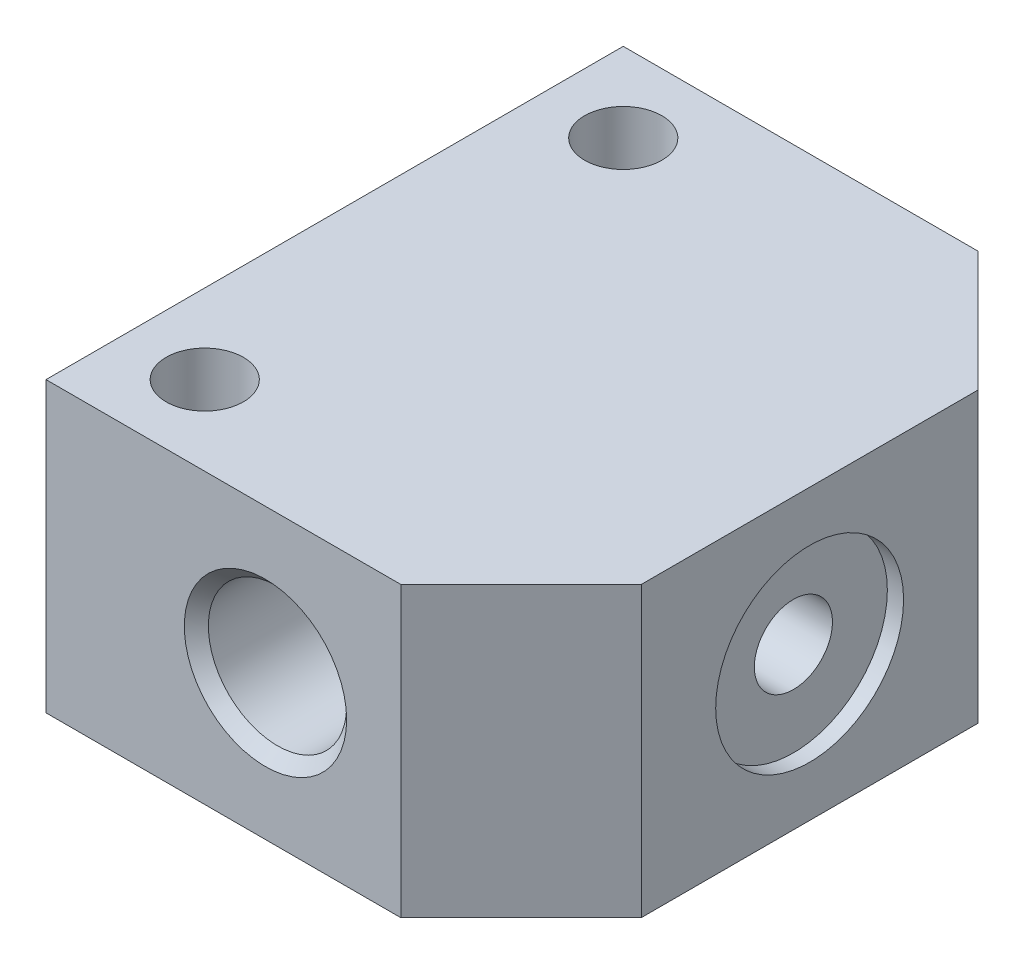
ISO-10303-21;
HEADER;
FILE_DESCRIPTION(('STEP AP214'),'2;1');
FILE_NAME('part.step','',(''),(''),'','','');
FILE_SCHEMA(('AUTOMOTIVE_DESIGN { 1 0 10303 214 1 1 1 1 }'));
ENDSEC;
DATA;
#1=APPLICATION_CONTEXT('core data for automotive mechanical design processes');
#2=APPLICATION_PROTOCOL_DEFINITION('international standard','automotive_design',2000,#1);
#3=PRODUCT_CONTEXT('',#1,'mechanical');
#4=PRODUCT('Part','Part','',(#3));
#5=PRODUCT_RELATED_PRODUCT_CATEGORY('part','',(#4));
#6=PRODUCT_DEFINITION_FORMATION('','',#4);
#7=PRODUCT_DEFINITION_CONTEXT('part definition',#1,'design');
#8=PRODUCT_DEFINITION('design','',#6,#7);
#9=PRODUCT_DEFINITION_SHAPE('','',#8);
#10=(LENGTH_UNIT() NAMED_UNIT(*) SI_UNIT(.MILLI.,.METRE.));
#11=(NAMED_UNIT(*) PLANE_ANGLE_UNIT() SI_UNIT($,.RADIAN.));
#12=(NAMED_UNIT(*) SI_UNIT($,.STERADIAN.) SOLID_ANGLE_UNIT());
#13=UNCERTAINTY_MEASURE_WITH_UNIT(LENGTH_MEASURE(1.E-05),#10,'distance_accuracy_value','');
#14=(GEOMETRIC_REPRESENTATION_CONTEXT(3) GLOBAL_UNCERTAINTY_ASSIGNED_CONTEXT((#13)) GLOBAL_UNIT_ASSIGNED_CONTEXT((#10,
#11,#12)) REPRESENTATION_CONTEXT('',''));
#15=CARTESIAN_POINT('',(0.,0.,0.));
#16=DIRECTION('',(0.,0.,1.));
#17=DIRECTION('',(1.,0.,0.));
#18=AXIS2_PLACEMENT_3D('',#15,#16,#17);
#19=CARTESIAN_POINT('',(10.795,6.096,24.384));
#20=DIRECTION('',(-1.,0.,0.));
#21=DIRECTION('',(0.,0.,1.));
#22=AXIS2_PLACEMENT_3D('',#19,#20,#21);
#23=PLANE('',#22);
#24=DIRECTION('',(0.,0.,-1.));
#25=VECTOR('',#24,1.);
#26=CARTESIAN_POINT('',(10.795,-6.096,24.384));
#27=LINE('',#26,#25);
#28=CARTESIAN_POINT('',(10.795,-6.096,19.304));
#29=VERTEX_POINT('',#28);
#30=CARTESIAN_POINT('',(10.795,-6.096,5.08000000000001));
#31=VERTEX_POINT('',#30);
#32=EDGE_CURVE('E117',#29,#31,#27,.T.);
#33=ORIENTED_EDGE('',*,*,#32,.T.);
#34=DIRECTION('',(0.,1.,0.));
#35=VECTOR('',#34,1.);
#36=CARTESIAN_POINT('',(10.795,6.096,5.08));
#37=LINE('',#36,#35);
#38=CARTESIAN_POINT('',(10.795,6.096,5.08000000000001));
#39=VERTEX_POINT('',#38);
#40=EDGE_CURVE('E242',#31,#39,#37,.T.);
#41=ORIENTED_EDGE('',*,*,#40,.T.);
#42=DIRECTION('',(0.,0.,-1.));
#43=VECTOR('',#42,1.);
#44=CARTESIAN_POINT('',(10.795,6.096,24.384));
#45=LINE('',#44,#43);
#46=CARTESIAN_POINT('',(10.795,6.096,19.304));
#47=VERTEX_POINT('',#46);
#48=EDGE_CURVE('E114',#47,#39,#45,.T.);
#49=ORIENTED_EDGE('',*,*,#48,.F.);
#50=DIRECTION('',(0.,-1.,0.));
#51=VECTOR('',#50,1.);
#52=CARTESIAN_POINT('',(10.795,-6.096,19.304));
#53=LINE('',#52,#51);
#54=EDGE_CURVE('E254',#47,#29,#53,.T.);
#55=ORIENTED_EDGE('',*,*,#54,.T.);
#56=EDGE_LOOP('',(#33,#41,#49,#55));
#57=FACE_BOUND('',#56,.T.);
#58=CARTESIAN_POINT('',(10.795,0.,12.192));
#59=DIRECTION('',(-1.,0.,0.));
#60=DIRECTION('',(0.,0.,1.));
#61=AXIS2_PLACEMENT_3D('',#58,#59,#60);
#62=CIRCLE('',#61,3.96875);
#63=CARTESIAN_POINT('',(10.795,0.,16.16075));
#64=VERTEX_POINT('',#63);
#65=EDGE_CURVE('E258',#64,#64,#62,.T.);
#66=ORIENTED_EDGE('',*,*,#65,.T.);
#67=EDGE_LOOP('',(#66));
#68=FACE_BOUND('',#67,.T.);
#69=ADVANCED_FACE('F32',(#57,#68),#23,.F.);
#70=CARTESIAN_POINT('',(-10.795,-6.096,0.));
#71=DIRECTION('',(0.,0.,1.));
#72=DIRECTION('',(1.,0.,0.));
#73=AXIS2_PLACEMENT_3D('',#70,#71,#72);
#74=PLANE('',#73);
#75=CARTESIAN_POINT('',(0.,0.,0.));
#76=DIRECTION('',(0.,0.,1.));
#77=DIRECTION('',(1.,0.,0.));
#78=AXIS2_PLACEMENT_3D('',#75,#76,#77);
#79=CIRCLE('',#78,3.429);
#80=CARTESIAN_POINT('',(3.429,0.,0.));
#81=VERTEX_POINT('',#80);
#82=EDGE_CURVE('E150',#81,#81,#79,.T.);
#83=ORIENTED_EDGE('',*,*,#82,.T.);
#84=EDGE_LOOP('',(#83));
#85=FACE_BOUND('',#84,.T.);
#86=DIRECTION('',(1.,0.,0.));
#87=VECTOR('',#86,1.);
#88=CARTESIAN_POINT('',(-10.795,-6.096,0.));
#89=LINE('',#88,#87);
#90=CARTESIAN_POINT('',(-9.271,-6.096,0.));
#91=VERTEX_POINT('',#90);
#92=CARTESIAN_POINT('',(5.71499999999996,-6.096,0.));
#93=VERTEX_POINT('',#92);
#94=EDGE_CURVE('E122',#91,#93,#89,.T.);
#95=ORIENTED_EDGE('',*,*,#94,.F.);
#96=DIRECTION('',(0.,-1.,0.));
#97=VECTOR('',#96,1.);
#98=CARTESIAN_POINT('',(-9.271,6.096,0.));
#99=LINE('',#98,#97);
#100=CARTESIAN_POINT('',(-9.271,6.096,0.));
#101=VERTEX_POINT('',#100);
#102=EDGE_CURVE('E109',#101,#91,#99,.T.);
#103=ORIENTED_EDGE('',*,*,#102,.F.);
#104=DIRECTION('',(-1.,0.,0.));
#105=VECTOR('',#104,1.);
#106=CARTESIAN_POINT('',(-10.795,6.096,0.));
#107=LINE('',#106,#105);
#108=CARTESIAN_POINT('',(5.71499999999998,6.096,0.));
#109=VERTEX_POINT('',#108);
#110=EDGE_CURVE('E108',#109,#101,#107,.T.);
#111=ORIENTED_EDGE('',*,*,#110,.F.);
#112=DIRECTION('',(0.,-1.,0.));
#113=VECTOR('',#112,1.);
#114=CARTESIAN_POINT('',(5.71499999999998,-6.096,0.));
#115=LINE('',#114,#113);
#116=EDGE_CURVE('E240',#109,#93,#115,.T.);
#117=ORIENTED_EDGE('',*,*,#116,.T.);
#118=EDGE_LOOP('',(#95,#103,#111,#117));
#119=FACE_BOUND('',#118,.T.);
#120=ADVANCED_FACE('F201',(#85,#119),#74,.F.);
#121=CARTESIAN_POINT('',(-10.795,-6.096,24.384));
#122=DIRECTION('',(0.,1.,0.));
#123=DIRECTION('',(0.,0.,1.));
#124=AXIS2_PLACEMENT_3D('',#121,#122,#123);
#125=PLANE('',#124);
#126=CARTESIAN_POINT('',(-5.9182,-6.096,21.0312));
#127=DIRECTION('',(0.,-1.,0.));
#128=DIRECTION('',(0.,0.,-1.));
#129=AXIS2_PLACEMENT_3D('',#126,#127,#128);
#130=CIRCLE('',#129,1.63195);
#131=CARTESIAN_POINT('',(-5.9182,-6.096,19.39925));
#132=VERTEX_POINT('',#131);
#133=EDGE_CURVE('E315',#132,#132,#130,.T.);
#134=ORIENTED_EDGE('',*,*,#133,.F.);
#135=EDGE_LOOP('',(#134));
#136=FACE_BOUND('',#135,.T.);
#137=CARTESIAN_POINT('',(-5.9182,-6.096,3.3528));
#138=DIRECTION('',(0.,-1.,0.));
#139=DIRECTION('',(0.,0.,-1.));
#140=AXIS2_PLACEMENT_3D('',#137,#138,#139);
#141=CIRCLE('',#140,1.63195);
#142=CARTESIAN_POINT('',(-5.9182,-6.096,1.72085));
#143=VERTEX_POINT('',#142);
#144=EDGE_CURVE('E100',#143,#143,#141,.T.);
#145=ORIENTED_EDGE('',*,*,#144,.F.);
#146=EDGE_LOOP('',(#145));
#147=FACE_BOUND('',#146,.T.);
#148=DIRECTION('',(1.,0.,0.));
#149=VECTOR('',#148,1.);
#150=CARTESIAN_POINT('',(-10.795,-6.096,24.384));
#151=LINE('',#150,#149);
#152=CARTESIAN_POINT('',(-9.271,-6.096,24.384));
#153=VERTEX_POINT('',#152);
#154=CARTESIAN_POINT('',(5.71499999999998,-6.096,24.384));
#155=VERTEX_POINT('',#154);
#156=EDGE_CURVE('E53',#153,#155,#151,.T.);
#157=ORIENTED_EDGE('',*,*,#156,.F.);
#158=DIRECTION('',(0.,0.,1.));
#159=VECTOR('',#158,1.);
#160=CARTESIAN_POINT('',(-9.271,-6.096,24.384));
#161=LINE('',#160,#159);
#162=EDGE_CURVE('E47',#91,#153,#161,.T.);
#163=ORIENTED_EDGE('',*,*,#162,.F.);
#164=ORIENTED_EDGE('',*,*,#94,.T.);
#165=DIRECTION('',(-0.707106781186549,0.,-0.707106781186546));
#166=VECTOR('',#165,1.);
#167=CARTESIAN_POINT('',(10.795,-6.096,5.08));
#168=LINE('',#167,#166);
#169=EDGE_CURVE('E40',#93,#31,#168,.F.);
#170=ORIENTED_EDGE('',*,*,#169,.T.);
#171=ORIENTED_EDGE('',*,*,#32,.F.);
#172=DIRECTION('',(-0.707106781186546,0.,0.707106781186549));
#173=VECTOR('',#172,1.);
#174=CARTESIAN_POINT('',(5.715,-6.096,24.384));
#175=LINE('',#174,#173);
#176=EDGE_CURVE('E245',#29,#155,#175,.T.);
#177=ORIENTED_EDGE('',*,*,#176,.T.);
#178=EDGE_LOOP('',(#157,#163,#164,#170,#171,#177));
#179=FACE_BOUND('',#178,.T.);
#180=ADVANCED_FACE('F207',(#136,#147,#179),#125,.F.);
#181=CARTESIAN_POINT('',(-10.795,6.096,24.384));
#182=DIRECTION('',(0.,-1.,0.));
#183=DIRECTION('',(0.,0.,-1.));
#184=AXIS2_PLACEMENT_3D('',#181,#182,#183);
#185=PLANE('',#184);
#186=CARTESIAN_POINT('',(-5.9182,6.096,21.0312));
#187=DIRECTION('',(0.,-1.,0.));
#188=DIRECTION('',(0.,0.,-1.));
#189=AXIS2_PLACEMENT_3D('',#186,#187,#188);
#190=CIRCLE('',#189,1.63195);
#191=CARTESIAN_POINT('',(-5.9182,6.096,19.39925));
#192=VERTEX_POINT('',#191);
#193=EDGE_CURVE('E310',#192,#192,#190,.T.);
#194=ORIENTED_EDGE('',*,*,#193,.T.);
#195=EDGE_LOOP('',(#194));
#196=FACE_BOUND('',#195,.T.);
#197=CARTESIAN_POINT('',(-5.9182,6.096,3.3528));
#198=DIRECTION('',(0.,-1.,0.));
#199=DIRECTION('',(0.,0.,-1.));
#200=AXIS2_PLACEMENT_3D('',#197,#198,#199);
#201=CIRCLE('',#200,1.63195);
#202=CARTESIAN_POINT('',(-5.9182,6.096,1.72085));
#203=VERTEX_POINT('',#202);
#204=EDGE_CURVE('E313',#203,#203,#201,.T.);
#205=ORIENTED_EDGE('',*,*,#204,.T.);
#206=EDGE_LOOP('',(#205));
#207=FACE_BOUND('',#206,.T.);
#208=ORIENTED_EDGE('',*,*,#110,.T.);
#209=DIRECTION('',(0.,0.,-1.));
#210=VECTOR('',#209,1.);
#211=CARTESIAN_POINT('',(-9.271,6.096,24.384));
#212=LINE('',#211,#210);
#213=CARTESIAN_POINT('',(-9.271,6.096,24.384));
#214=VERTEX_POINT('',#213);
#215=EDGE_CURVE('E97',#214,#101,#212,.T.);
#216=ORIENTED_EDGE('',*,*,#215,.F.);
#217=DIRECTION('',(-1.,0.,0.));
#218=VECTOR('',#217,1.);
#219=CARTESIAN_POINT('',(-10.795,6.096,24.384));
#220=LINE('',#219,#218);
#221=CARTESIAN_POINT('',(5.71499999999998,6.096,24.384));
#222=VERTEX_POINT('',#221);
#223=EDGE_CURVE('E106',#222,#214,#220,.T.);
#224=ORIENTED_EDGE('',*,*,#223,.F.);
#225=DIRECTION('',(0.707106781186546,0.,-0.707106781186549));
#226=VECTOR('',#225,1.);
#227=CARTESIAN_POINT('',(5.715,6.096,24.384));
#228=LINE('',#227,#226);
#229=EDGE_CURVE('E251',#222,#47,#228,.T.);
#230=ORIENTED_EDGE('',*,*,#229,.T.);
#231=ORIENTED_EDGE('',*,*,#48,.T.);
#232=DIRECTION('',(0.707106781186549,0.,0.707106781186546));
#233=VECTOR('',#232,1.);
#234=CARTESIAN_POINT('',(10.795,6.096,5.08));
#235=LINE('',#234,#233);
#236=EDGE_CURVE('E249',#39,#109,#235,.F.);
#237=ORIENTED_EDGE('',*,*,#236,.T.);
#238=EDGE_LOOP('',(#208,#216,#224,#230,#231,#237));
#239=FACE_BOUND('',#238,.T.);
#240=ADVANCED_FACE('F105',(#196,#207,#239),#185,.F.);
#241=CARTESIAN_POINT('',(-10.795,-6.096,24.384));
#242=DIRECTION('',(0.,0.,1.));
#243=DIRECTION('',(1.,0.,0.));
#244=AXIS2_PLACEMENT_3D('',#241,#242,#243);
#245=PLANE('',#244);
#246=DIRECTION('',(0.,1.,0.));
#247=VECTOR('',#246,1.);
#248=CARTESIAN_POINT('',(-9.271,6.096,24.384));
#249=LINE('',#248,#247);
#250=EDGE_CURVE('E94',#153,#214,#249,.T.);
#251=ORIENTED_EDGE('',*,*,#250,.F.);
#252=ORIENTED_EDGE('',*,*,#156,.T.);
#253=DIRECTION('',(0.,1.,0.));
#254=VECTOR('',#253,1.);
#255=CARTESIAN_POINT('',(5.715,6.096,24.384));
#256=LINE('',#255,#254);
#257=EDGE_CURVE('E11',#155,#222,#256,.T.);
#258=ORIENTED_EDGE('',*,*,#257,.T.);
#259=ORIENTED_EDGE('',*,*,#223,.T.);
#260=EDGE_LOOP('',(#251,#252,#258,#259));
#261=FACE_BOUND('',#260,.T.);
#262=CARTESIAN_POINT('',(0.,0.,24.384));
#263=DIRECTION('',(0.,0.,1.));
#264=DIRECTION('',(1.,0.,0.));
#265=AXIS2_PLACEMENT_3D('',#262,#263,#264);
#266=CIRCLE('',#265,3.42900000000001);
#267=CARTESIAN_POINT('',(3.42900000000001,0.,24.384));
#268=VERTEX_POINT('',#267);
#269=EDGE_CURVE('E147',#268,#268,#266,.F.);
#270=ORIENTED_EDGE('',*,*,#269,.T.);
#271=EDGE_LOOP('',(#270));
#272=FACE_BOUND('',#271,.T.);
#273=ADVANCED_FACE('F111',(#261,#272),#245,.T.);
#274=CARTESIAN_POINT('',(0.,0.,8.89));
#275=DIRECTION('',(0.,0.,-1.));
#276=DIRECTION('',(-1.,0.,0.));
#277=AXIS2_PLACEMENT_3D('',#274,#275,#276);
#278=CYLINDRICAL_SURFACE('',#277,2.921);
#279=CARTESIAN_POINT('',(0.,0.,0.508000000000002));
#280=DIRECTION('',(0.,0.,1.));
#281=DIRECTION('',(1.,0.,0.));
#282=AXIS2_PLACEMENT_3D('',#279,#280,#281);
#283=CIRCLE('',#282,2.921);
#284=CARTESIAN_POINT('',(2.921,0.,0.508000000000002));
#285=VERTEX_POINT('',#284);
#286=EDGE_CURVE('E153',#285,#285,#283,.F.);
#287=ORIENTED_EDGE('',*,*,#286,.T.);
#288=EDGE_LOOP('',(#287));
#289=FACE_BOUND('',#288,.T.);
#290=CARTESIAN_POINT('',(0.,0.,8.7122));
#291=DIRECTION('',(0.,0.,1.));
#292=DIRECTION('',(1.,0.,0.));
#293=AXIS2_PLACEMENT_3D('',#290,#291,#292);
#294=CIRCLE('',#293,2.921);
#295=CARTESIAN_POINT('',(2.921,0.,8.7122));
#296=VERTEX_POINT('',#295);
#297=EDGE_CURVE('E128',#296,#296,#294,.T.);
#298=ORIENTED_EDGE('',*,*,#297,.T.);
#299=EDGE_LOOP('',(#298));
#300=FACE_BOUND('',#299,.T.);
#301=ADVANCED_FACE('F290',(#289,#300),#278,.F.);
#302=CARTESIAN_POINT('',(0.,0.,8.89));
#303=DIRECTION('',(0.,0.,1.));
#304=DIRECTION('',(1.,0.,0.));
#305=AXIS2_PLACEMENT_3D('',#302,#303,#304);
#306=PLANE('',#305);
#307=CARTESIAN_POINT('',(0.,0.,8.89));
#308=DIRECTION('',(0.,0.,1.));
#309=DIRECTION('',(1.,0.,0.));
#310=AXIS2_PLACEMENT_3D('',#307,#308,#309);
#311=CIRCLE('',#310,2.7432);
#312=CARTESIAN_POINT('',(2.7432,0.,8.89));
#313=VERTEX_POINT('',#312);
#314=EDGE_CURVE('E131',#313,#313,#311,.F.);
#315=ORIENTED_EDGE('',*,*,#314,.T.);
#316=EDGE_LOOP('',(#315));
#317=FACE_BOUND('',#316,.T.);
#318=CARTESIAN_POINT('',(0.,0.,8.89));
#319=DIRECTION('',(0.,0.,-1.));
#320=DIRECTION('',(-1.,0.,0.));
#321=AXIS2_PLACEMENT_3D('',#318,#319,#320);
#322=CIRCLE('',#321,1.0033);
#323=CARTESIAN_POINT('',(-1.0033,0.,8.89));
#324=VERTEX_POINT('',#323);
#325=EDGE_CURVE('E124',#324,#324,#322,.T.);
#326=ORIENTED_EDGE('',*,*,#325,.F.);
#327=EDGE_LOOP('',(#326));
#328=FACE_BOUND('',#327,.T.);
#329=ADVANCED_FACE('F288',(#317,#328),#306,.F.);
#330=CARTESIAN_POINT('',(0.,0.,24.384));
#331=DIRECTION('',(0.,0.,-1.));
#332=DIRECTION('',(-1.,0.,0.));
#333=AXIS2_PLACEMENT_3D('',#330,#331,#332);
#334=CYLINDRICAL_SURFACE('',#333,1.0033);
#335=CARTESIAN_POINT('',(0.965199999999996,-0.273861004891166,13.6911918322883));
#336=CARTESIAN_POINT('',(0.971762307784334,-0.250735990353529,13.6954179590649));
#337=CARTESIAN_POINT('',(0.977513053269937,-0.227296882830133,13.6991441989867));
#338=CARTESIAN_POINT('',(0.987332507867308,-0.179919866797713,13.7055309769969));
#339=CARTESIAN_POINT('',(0.991400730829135,-0.155981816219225,13.7081912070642));
#340=CARTESIAN_POINT('',(1.00080788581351,-0.0849943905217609,13.7143525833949));
#341=CARTESIAN_POINT('',(1.00372370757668,-0.0374507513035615,13.7162786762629));
#342=CARTESIAN_POINT('',(1.00280834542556,0.0542716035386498,13.7156765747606));
#343=CARTESIAN_POINT('',(0.999425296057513,0.0984579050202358,13.7134442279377));
#344=CARTESIAN_POINT('',(0.989997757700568,0.164401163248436,13.7072740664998));
#345=CARTESIAN_POINT('',(0.986048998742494,0.186611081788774,13.7046944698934));
#346=CARTESIAN_POINT('',(0.976700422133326,0.230591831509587,13.6986176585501));
#347=CARTESIAN_POINT('',(0.97130087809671,0.252362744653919,13.6951206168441));
#348=CARTESIAN_POINT('',(0.965199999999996,0.273861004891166,13.6911918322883));
#349=B_SPLINE_CURVE_WITH_KNOTS('',3,(#335,#336,#337,#338,#339,#340,#341,#342,#343,#344,#345,
#346,#347,#348),.UNSPECIFIED.,.F.,.F.,(4,2,2,2,2,2,4),(0.,0.0731831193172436,0.1463873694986,
0.288665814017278,0.421206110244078,0.489260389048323,0.557301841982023),.UNSPECIFIED.);
#350=CARTESIAN_POINT('',(0.965199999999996,-0.273861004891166,13.6911918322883));
#351=VERTEX_POINT('',#350);
#352=CARTESIAN_POINT('',(0.965199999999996,0.273861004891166,13.6911918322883));
#353=VERTEX_POINT('',#352);
#354=EDGE_CURVE('E164',#351,#353,#349,.T.);
#355=ORIENTED_EDGE('',*,*,#354,.F.);
#356=CARTESIAN_POINT('',(-0.199105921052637,0.983345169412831,12.192));
#357=CARTESIAN_POINT('',(-0.199093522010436,0.983354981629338,12.2530162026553));
#358=CARTESIAN_POINT('',(-0.193230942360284,0.984590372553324,12.3141130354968));
#359=CARTESIAN_POINT('',(-0.170594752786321,0.988750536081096,12.4342469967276));
#360=CARTESIAN_POINT('',(-0.153787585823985,0.991680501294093,12.4932772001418));
#361=CARTESIAN_POINT('',(-0.105847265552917,0.998057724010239,12.6223137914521));
#362=CARTESIAN_POINT('',(-0.072180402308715,1.00145075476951,12.6913664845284));
#363=CARTESIAN_POINT('',(0.00527262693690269,1.00403345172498,12.8236060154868));
#364=CARTESIAN_POINT('',(0.0490735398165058,1.00321695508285,12.8867841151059));
#365=CARTESIAN_POINT('',(0.14458842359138,0.994016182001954,13.0088733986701));
#366=CARTESIAN_POINT('',(0.196475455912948,0.985439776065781,13.0676350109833));
#367=CARTESIAN_POINT('',(0.303910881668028,0.957768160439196,13.1789728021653));
#368=CARTESIAN_POINT('',(0.359454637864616,0.938686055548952,13.2315565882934));
#369=CARTESIAN_POINT('',(0.461785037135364,0.892188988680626,13.3222640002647));
#370=CARTESIAN_POINT('',(0.508544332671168,0.866606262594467,13.361353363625));
#371=CARTESIAN_POINT('',(0.599911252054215,0.806047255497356,13.4344802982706));
#372=CARTESIAN_POINT('',(0.644520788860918,0.771079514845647,13.4685224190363));
#373=CARTESIAN_POINT('',(0.722747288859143,0.697625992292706,13.5262602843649));
#374=CARTESIAN_POINT('',(0.757010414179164,0.660448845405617,13.5507419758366));
#375=CARTESIAN_POINT('',(0.820542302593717,0.57962009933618,13.5951471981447));
#376=CARTESIAN_POINT('',(0.849812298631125,0.535970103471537,13.6150718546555));
#377=CARTESIAN_POINT('',(0.901895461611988,0.442786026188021,13.6499712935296));
#378=CARTESIAN_POINT('',(0.924671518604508,0.393220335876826,13.6649177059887));
#379=CARTESIAN_POINT('',(0.962096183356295,0.289825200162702,13.6892420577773));
#380=CARTESIAN_POINT('',(0.976749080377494,0.235998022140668,13.6986229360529));
#381=CARTESIAN_POINT('',(0.995869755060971,0.13176834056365,13.7108197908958));
#382=CARTESIAN_POINT('',(1.00124496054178,0.0815991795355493,13.7142213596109));
#383=CARTESIAN_POINT('',(1.0043803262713,-0.0190630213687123,13.7162084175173));
#384=CARTESIAN_POINT('',(1.00214340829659,-0.0695559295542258,13.7147957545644));
#385=CARTESIAN_POINT('',(0.990497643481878,-0.166730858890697,13.7073953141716));
#386=CARTESIAN_POINT('',(0.981458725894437,-0.213476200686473,13.7016434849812));
#387=CARTESIAN_POINT('',(0.957115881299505,-0.304570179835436,13.6859984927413));
#388=CARTESIAN_POINT('',(0.941811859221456,-0.348918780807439,13.6761052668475));
#389=CARTESIAN_POINT('',(0.905218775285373,-0.435251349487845,13.6521148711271));
#390=CARTESIAN_POINT('',(0.883788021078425,-0.477147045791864,13.6379176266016));
#391=CARTESIAN_POINT('',(0.836108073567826,-0.556487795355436,13.6057311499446));
#392=CARTESIAN_POINT('',(0.809857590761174,-0.593931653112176,13.5877409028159));
#393=CARTESIAN_POINT('',(0.751094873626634,-0.666975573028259,13.5465217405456));
#394=CARTESIAN_POINT('',(0.718232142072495,-0.702108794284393,13.5229676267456));
#395=CARTESIAN_POINT('',(0.649481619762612,-0.766156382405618,13.4721404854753));
#396=CARTESIAN_POINT('',(0.613592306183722,-0.795067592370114,13.4448655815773));
#397=CARTESIAN_POINT('',(0.534875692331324,-0.850382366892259,13.3827871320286));
#398=CARTESIAN_POINT('',(0.491790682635,-0.875834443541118,13.3474647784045));
#399=CARTESIAN_POINT('',(0.405303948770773,-0.919065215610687,13.2728087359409));
#400=CARTESIAN_POINT('',(0.361902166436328,-0.936842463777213,13.2334742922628));
#401=CARTESIAN_POINT('',(0.268624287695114,-0.968136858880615,13.1434658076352));
#402=CARTESIAN_POINT('',(0.219017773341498,-0.980278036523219,13.0920341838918));
#403=CARTESIAN_POINT('',(0.124237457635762,-0.996744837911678,12.9839043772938));
#404=CARTESIAN_POINT('',(0.0790753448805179,-1.00105034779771,12.9271930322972));
#405=CARTESIAN_POINT('',(-0.0112509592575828,-1.00441480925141,12.7982179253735));
#406=CARTESIAN_POINT('',(-0.0550583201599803,-1.0024348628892,12.7249623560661));
#407=CARTESIAN_POINT('',(-0.12750873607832,-0.995842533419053,12.5714860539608));
#408=CARTESIAN_POINT('',(-0.156220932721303,-0.991242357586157,12.4912990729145));
#409=CARTESIAN_POINT('',(-0.186784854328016,-0.985835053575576,12.3552707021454));
#410=CARTESIAN_POINT('',(-0.194533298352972,-0.984262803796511,12.3007922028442));
#411=CARTESIAN_POINT('',(-0.200652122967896,-0.983037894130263,12.1913023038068));
#412=CARTESIAN_POINT('',(-0.199030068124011,-0.983383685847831,12.1362913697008));
#413=CARTESIAN_POINT('',(-0.186628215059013,-0.985806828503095,12.0275569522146));
#414=CARTESIAN_POINT('',(-0.17587570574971,-0.987879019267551,11.9738301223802));
#415=CARTESIAN_POINT('',(-0.146374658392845,-0.992676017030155,11.8686238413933));
#416=CARTESIAN_POINT('',(-0.127612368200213,-0.995401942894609,11.8171484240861));
#417=CARTESIAN_POINT('',(-0.0733425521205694,-1.00113465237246,11.6938628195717));
#418=CARTESIAN_POINT('',(-0.0341042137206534,-1.00368648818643,11.6236800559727));
#419=CARTESIAN_POINT('',(0.0540700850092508,-1.00281418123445,11.4896899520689));
#420=CARTESIAN_POINT('',(0.103024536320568,-0.999378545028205,11.4258951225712));
#421=CARTESIAN_POINT('',(0.208166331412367,-0.982944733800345,11.3031535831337));
#422=CARTESIAN_POINT('',(0.264500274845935,-0.96971670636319,11.2443619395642));
#423=CARTESIAN_POINT('',(0.37950769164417,-0.930729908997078,11.1336963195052));
#424=CARTESIAN_POINT('',(0.438176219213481,-0.904996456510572,11.0818086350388));
#425=CARTESIAN_POINT('',(0.539985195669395,-0.847113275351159,10.9969729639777));
#426=CARTESIAN_POINT('',(0.583506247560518,-0.817935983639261,10.9624526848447));
#427=CARTESIAN_POINT('',(0.667461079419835,-0.750988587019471,10.8982259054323));
#428=CARTESIAN_POINT('',(0.707895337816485,-0.713219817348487,10.8685186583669));
#429=CARTESIAN_POINT('',(0.783725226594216,-0.628984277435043,10.8143214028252));
#430=CARTESIAN_POINT('',(0.819079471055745,-0.582452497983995,10.789873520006));
#431=CARTESIAN_POINT('',(0.882007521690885,-0.481853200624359,10.7472030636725));
#432=CARTESIAN_POINT('',(0.909588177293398,-0.427792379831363,10.7289750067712));
#433=CARTESIAN_POINT('',(0.951787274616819,-0.321736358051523,10.7014138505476));
#434=CARTESIAN_POINT('',(0.967661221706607,-0.270466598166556,10.6912061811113));
#435=CARTESIAN_POINT('',(0.991050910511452,-0.165297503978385,10.6762374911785));
#436=CARTESIAN_POINT('',(0.998572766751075,-0.111400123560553,10.6714724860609));
#437=CARTESIAN_POINT('',(1.00445377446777,-0.00842317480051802,10.6677448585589));
#438=CARTESIAN_POINT('',(1.0036646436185,0.0405907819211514,10.6682428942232));
#439=CARTESIAN_POINT('',(0.994996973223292,0.137721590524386,10.6737431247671));
#440=CARTESIAN_POINT('',(0.987120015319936,0.185838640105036,10.6787443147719));
#441=CARTESIAN_POINT('',(0.964925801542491,0.278877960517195,10.6929683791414));
#442=CARTESIAN_POINT('',(0.950737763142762,0.323844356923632,10.7021066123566));
#443=CARTESIAN_POINT('',(0.916660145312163,0.410504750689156,10.724349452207));
#444=CARTESIAN_POINT('',(0.89676974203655,0.452198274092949,10.7374546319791));
#445=CARTESIAN_POINT('',(0.851004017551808,0.533568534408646,10.7681392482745));
#446=CARTESIAN_POINT('',(0.824868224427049,0.573022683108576,10.7859183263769));
#447=CARTESIAN_POINT('',(0.768436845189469,0.6467406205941,10.8252043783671));
#448=CARTESIAN_POINT('',(0.738139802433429,0.681002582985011,10.8467126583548));
#449=CARTESIAN_POINT('',(0.671000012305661,0.74756089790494,10.8957290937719));
#450=CARTESIAN_POINT('',(0.633804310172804,0.779202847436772,10.9236399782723));
#451=CARTESIAN_POINT('',(0.557322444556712,0.835622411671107,10.9832410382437));
#452=CARTESIAN_POINT('',(0.518035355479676,0.86039695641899,11.014932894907));
#453=CARTESIAN_POINT('',(0.432436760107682,0.90683204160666,11.0871757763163));
#454=CARTESIAN_POINT('',(0.386014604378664,0.927345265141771,11.1283311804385));
#455=CARTESIAN_POINT('',(0.294399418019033,0.960373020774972,11.2149927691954));
#456=CARTESIAN_POINT('',(0.249207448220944,0.972880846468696,11.2605025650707));
#457=CARTESIAN_POINT('',(0.153614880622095,0.99288841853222,11.3648849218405));
#458=CARTESIAN_POINT('',(0.103883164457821,0.998963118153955,11.4246444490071));
#459=CARTESIAN_POINT('',(0.012214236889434,1.00427549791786,11.5502263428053));
#460=CARTESIAN_POINT('',(-0.0297201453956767,1.00351070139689,11.6160508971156));
#461=CARTESIAN_POINT('',(-0.0944445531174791,0.999257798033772,11.7392364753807));
#462=CARTESIAN_POINT('',(-0.119405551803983,0.996375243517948,11.7954724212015));
#463=CARTESIAN_POINT('',(-0.159962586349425,0.990682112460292,11.9111562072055));
#464=CARTESIAN_POINT('',(-0.175591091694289,0.987871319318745,11.9705921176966));
#465=CARTESIAN_POINT('',(-0.190108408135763,0.985133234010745,12.0575313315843));
#466=CARTESIAN_POINT('',(-0.193470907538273,0.984472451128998,12.084303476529));
#467=CARTESIAN_POINT('',(-0.197972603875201,0.983576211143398,12.1380451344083));
#468=CARTESIAN_POINT('',(-0.199111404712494,0.983340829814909,12.1650146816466));
#469=CARTESIAN_POINT('',(-0.199105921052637,0.983345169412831,12.192));
#470=B_SPLINE_CURVE_WITH_KNOTS('',3,(#356,#357,#358,#359,#360,#361,#362,#363,#364,#365,#366,
#367,#368,#369,#370,#371,#372,#373,#374,#375,#376,#377,#378,#379,#380,#381,#382,#383,#384,#385,
#386,#387,#388,#389,#390,#391,#392,#393,#394,#395,#396,#397,#398,#399,#400,#401,#402,#403,#404,
#405,#406,#407,#408,#409,#410,#411,#412,#413,#414,#415,#416,#417,#418,#419,#420,#421,#422,#423,
#424,#425,#426,#427,#428,#429,#430,#431,#432,#433,#434,#435,#436,#437,#438,#439,#440,#441,#442,
#443,#444,#445,#446,#447,#448,#449,#450,#451,#452,#453,#454,#455,#456,#457,#458,#459,#460,#461,
#462,#463,#464,#465,#466,#467,#468,#469),.UNSPECIFIED.,.T.,.F.,(4,2,2,2,2,2,2,2,2,2,2,2,2,2,2,2,
2,2,2,2,2,2,2,2,2,2,2,2,2,2,2,2,2,2,2,2,2,2,2,2,2,2,2,2,2,2,2,2,2,2,2,2,2,2,2,2,4),(0.,
0.182926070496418,0.366415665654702,0.595860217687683,0.825640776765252,1.0612710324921,
1.29660802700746,1.49412050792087,1.69145385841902,1.85926963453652,2.02704391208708,
2.19575856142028,2.36438403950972,2.51531478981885,2.66618761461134,2.80939971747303,
2.952613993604,3.09945342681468,3.24633220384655,3.40638902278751,3.56652686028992,
3.74958950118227,3.93268664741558,4.14930805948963,4.36648475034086,4.6213098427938,
4.87495733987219,5.03934422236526,5.20359841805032,5.36736341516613,5.53141072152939,
5.7714580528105,6.01196668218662,6.25830716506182,6.50415099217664,6.69164590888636,
6.8791117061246,7.06802731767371,7.25677594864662,7.4197585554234,7.5826217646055,
7.72897152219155,7.87528863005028,8.01873875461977,8.16220961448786,8.31325276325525,
8.46434891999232,8.63243783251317,8.80060176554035,8.99589737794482,9.19135638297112,
9.4243914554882,9.65751091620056,9.84168067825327,10.0252058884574,10.1060932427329,
10.1869950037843),.UNSPECIFIED.);
#471=CARTESIAN_POINT('',(0.965199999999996,-0.273861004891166,10.6928081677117));
#472=VERTEX_POINT('',#471);
#473=EDGE_CURVE('E274',#351,#472,#470,.T.);
#474=ORIENTED_EDGE('',*,*,#473,.T.);
#475=CARTESIAN_POINT('',(0.965199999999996,0.273861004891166,10.6928081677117));
#476=CARTESIAN_POINT('',(0.971762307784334,0.250735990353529,10.6885820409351));
#477=CARTESIAN_POINT('',(0.977513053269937,0.227296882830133,10.6848558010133));
#478=CARTESIAN_POINT('',(0.987332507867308,0.179919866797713,10.6784690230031));
#479=CARTESIAN_POINT('',(0.991400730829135,0.155981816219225,10.6758087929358));
#480=CARTESIAN_POINT('',(1.00080788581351,0.0849943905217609,10.6696474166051));
#481=CARTESIAN_POINT('',(1.00372370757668,0.0374507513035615,10.6677213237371));
#482=CARTESIAN_POINT('',(1.00280834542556,-0.0542716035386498,10.6683234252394));
#483=CARTESIAN_POINT('',(0.999425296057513,-0.0984579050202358,10.6705557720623));
#484=CARTESIAN_POINT('',(0.989997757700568,-0.164401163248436,10.6767259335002));
#485=CARTESIAN_POINT('',(0.986048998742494,-0.186611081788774,10.6793055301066));
#486=CARTESIAN_POINT('',(0.976700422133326,-0.230591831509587,10.6853823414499));
#487=CARTESIAN_POINT('',(0.97130087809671,-0.252362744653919,10.6888793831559));
#488=CARTESIAN_POINT('',(0.965199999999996,-0.273861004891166,10.6928081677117));
#489=B_SPLINE_CURVE_WITH_KNOTS('',3,(#475,#476,#477,#478,#479,#480,#481,#482,#483,#484,#485,
#486,#487,#488),.UNSPECIFIED.,.F.,.F.,(4,2,2,2,2,2,4),(0.,0.0731831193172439,0.1463873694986,
0.288665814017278,0.421206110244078,0.489260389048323,0.557301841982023),.UNSPECIFIED.);
#490=CARTESIAN_POINT('',(0.965199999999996,0.273861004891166,10.6928081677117));
#491=VERTEX_POINT('',#490);
#492=EDGE_CURVE('E156',#491,#472,#489,.T.);
#493=ORIENTED_EDGE('',*,*,#492,.F.);
#494=EDGE_CURVE('E281',#491,#353,#470,.T.);
#495=ORIENTED_EDGE('',*,*,#494,.T.);
#496=EDGE_LOOP('',(#355,#474,#493,#495));
#497=FACE_BOUND('',#496,.T.);
#498=CARTESIAN_POINT('',(0.,0.,15.494));
#499=DIRECTION('',(0.,0.,-1.));
#500=DIRECTION('',(-1.,0.,0.));
#501=AXIS2_PLACEMENT_3D('',#498,#499,#500);
#502=CIRCLE('',#501,1.0033);
#503=CARTESIAN_POINT('',(-1.0033,0.,15.494));
#504=VERTEX_POINT('',#503);
#505=EDGE_CURVE('E135',#504,#504,#502,.F.);
#506=ORIENTED_EDGE('',*,*,#505,.T.);
#507=EDGE_LOOP('',(#506));
#508=FACE_BOUND('',#507,.T.);
#509=ORIENTED_EDGE('',*,*,#325,.T.);
#510=EDGE_LOOP('',(#509));
#511=FACE_BOUND('',#510,.T.);
#512=ADVANCED_FACE('F169',(#497,#508,#511),#334,.F.);
#513=CARTESIAN_POINT('',(0.,0.,8.7122));
#514=DIRECTION('',(0.,0.,1.));
#515=DIRECTION('',(1.,0.,0.));
#516=AXIS2_PLACEMENT_3D('',#513,#514,#515);
#517=TOROIDAL_SURFACE('',#516,2.7432,0.1778);
#518=ORIENTED_EDGE('',*,*,#314,.F.);
#519=EDGE_LOOP('',(#518));
#520=FACE_BOUND('',#519,.T.);
#521=ORIENTED_EDGE('',*,*,#297,.F.);
#522=EDGE_LOOP('',(#521));
#523=FACE_BOUND('',#522,.T.);
#524=ADVANCED_FACE('F188',(#520,#523),#517,.F.);
#525=CARTESIAN_POINT('',(0.,0.,15.494));
#526=DIRECTION('',(0.,0.,-1.));
#527=DIRECTION('',(1.,0.,0.));
#528=AXIS2_PLACEMENT_3D('',#525,#526,#527);
#529=PLANE('',#528);
#530=CARTESIAN_POINT('',(0.,0.,15.494));
#531=DIRECTION('',(0.,0.,-1.));
#532=DIRECTION('',(-1.,0.,0.));
#533=AXIS2_PLACEMENT_3D('',#530,#531,#532);
#534=CIRCLE('',#533,2.7432);
#535=CARTESIAN_POINT('',(-2.7432,0.,15.494));
#536=VERTEX_POINT('',#535);
#537=EDGE_CURVE('E134',#536,#536,#534,.F.);
#538=ORIENTED_EDGE('',*,*,#537,.T.);
#539=EDGE_LOOP('',(#538));
#540=FACE_BOUND('',#539,.T.);
#541=ORIENTED_EDGE('',*,*,#505,.F.);
#542=EDGE_LOOP('',(#541));
#543=FACE_BOUND('',#542,.T.);
#544=ADVANCED_FACE('F184',(#540,#543),#529,.F.);
#545=CARTESIAN_POINT('',(0.,0.,15.494));
#546=DIRECTION('',(0.,0.,1.));
#547=DIRECTION('',(1.,0.,0.));
#548=AXIS2_PLACEMENT_3D('',#545,#546,#547);
#549=CYLINDRICAL_SURFACE('',#548,2.921);
#550=CARTESIAN_POINT('',(0.,0.,23.876));
#551=DIRECTION('',(0.,0.,1.));
#552=DIRECTION('',(1.,0.,0.));
#553=AXIS2_PLACEMENT_3D('',#550,#551,#552);
#554=CIRCLE('',#553,2.921);
#555=CARTESIAN_POINT('',(2.921,0.,23.876));
#556=VERTEX_POINT('',#555);
#557=EDGE_CURVE('E144',#556,#556,#554,.T.);
#558=ORIENTED_EDGE('',*,*,#557,.T.);
#559=EDGE_LOOP('',(#558));
#560=FACE_BOUND('',#559,.T.);
#561=CARTESIAN_POINT('',(0.,0.,15.6718));
#562=DIRECTION('',(0.,0.,-1.));
#563=DIRECTION('',(-1.,0.,0.));
#564=AXIS2_PLACEMENT_3D('',#561,#562,#563);
#565=CIRCLE('',#564,2.921);
#566=CARTESIAN_POINT('',(-2.921,0.,15.6718));
#567=VERTEX_POINT('',#566);
#568=EDGE_CURVE('E141',#567,#567,#565,.T.);
#569=ORIENTED_EDGE('',*,*,#568,.T.);
#570=EDGE_LOOP('',(#569));
#571=FACE_BOUND('',#570,.T.);
#572=ADVANCED_FACE('F187',(#560,#571),#549,.F.);
#573=CARTESIAN_POINT('',(0.,0.,15.6718));
#574=DIRECTION('',(0.,0.,-1.));
#575=DIRECTION('',(-1.,0.,0.));
#576=AXIS2_PLACEMENT_3D('',#573,#574,#575);
#577=TOROIDAL_SURFACE('',#576,2.7432,0.1778);
#578=ORIENTED_EDGE('',*,*,#568,.F.);
#579=EDGE_LOOP('',(#578));
#580=FACE_BOUND('',#579,.T.);
#581=ORIENTED_EDGE('',*,*,#537,.F.);
#582=EDGE_LOOP('',(#581));
#583=FACE_BOUND('',#582,.T.);
#584=ADVANCED_FACE('F191',(#580,#583),#577,.F.);
#585=CARTESIAN_POINT('',(0.,0.,23.876));
#586=DIRECTION('',(0.,0.,1.));
#587=DIRECTION('',(1.,0.,0.));
#588=AXIS2_PLACEMENT_3D('',#585,#586,#587);
#589=CONICAL_SURFACE('',#588,2.921,0.785398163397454);
#590=ORIENTED_EDGE('',*,*,#269,.F.);
#591=EDGE_LOOP('',(#590));
#592=FACE_BOUND('',#591,.T.);
#593=ORIENTED_EDGE('',*,*,#557,.F.);
#594=EDGE_LOOP('',(#593));
#595=FACE_BOUND('',#594,.T.);
#596=ADVANCED_FACE('F196',(#592,#595),#589,.F.);
#597=CARTESIAN_POINT('',(0.,0.,0.));
#598=DIRECTION('',(0.,0.,-1.));
#599=DIRECTION('',(-1.,0.,0.));
#600=AXIS2_PLACEMENT_3D('',#597,#598,#599);
#601=CONICAL_SURFACE('',#600,3.429,0.785398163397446);
#602=ORIENTED_EDGE('',*,*,#286,.F.);
#603=EDGE_LOOP('',(#602));
#604=FACE_BOUND('',#603,.T.);
#605=ORIENTED_EDGE('',*,*,#82,.F.);
#606=EDGE_LOOP('',(#605));
#607=FACE_BOUND('',#606,.T.);
#608=ADVANCED_FACE('F179',(#604,#607),#601,.F.);
#609=CARTESIAN_POINT('',(0.965199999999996,0.,12.192));
#610=DIRECTION('',(1.,0.,0.));
#611=DIRECTION('',(0.,0.,-1.));
#612=AXIS2_PLACEMENT_3D('',#609,#610,#611);
#613=CYLINDRICAL_SURFACE('',#612,1.524);
#614=CARTESIAN_POINT('',(4.064,0.,12.192));
#615=DIRECTION('',(-1.,0.,0.));
#616=DIRECTION('',(0.,0.,1.));
#617=AXIS2_PLACEMENT_3D('',#614,#615,#616);
#618=CIRCLE('',#617,1.524);
#619=CARTESIAN_POINT('',(4.064,0.,13.716));
#620=VERTEX_POINT('',#619);
#621=EDGE_CURVE('E256',#620,#620,#618,.T.);
#622=ORIENTED_EDGE('',*,*,#621,.F.);
#623=EDGE_LOOP('',(#622));
#624=FACE_BOUND('',#623,.T.);
#625=ORIENTED_EDGE('',*,*,#354,.T.);
#626=CARTESIAN_POINT('',(0.965199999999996,0.,12.192));
#627=DIRECTION('',(-1.,0.,0.));
#628=DIRECTION('',(0.,0.,1.));
#629=AXIS2_PLACEMENT_3D('',#626,#627,#628);
#630=CIRCLE('',#629,1.524);
#631=EDGE_CURVE('E138',#353,#491,#630,.T.);
#632=ORIENTED_EDGE('',*,*,#631,.T.);
#633=ORIENTED_EDGE('',*,*,#492,.T.);
#634=EDGE_CURVE('E283',#472,#351,#630,.T.);
#635=ORIENTED_EDGE('',*,*,#634,.T.);
#636=EDGE_LOOP('',(#625,#632,#633,#635));
#637=FACE_BOUND('',#636,.T.);
#638=ADVANCED_FACE('F173',(#624,#637),#613,.F.);
#639=CARTESIAN_POINT('',(0.965199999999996,0.,12.192));
#640=DIRECTION('',(1.,0.,0.));
#641=DIRECTION('',(0.,0.,1.));
#642=AXIS2_PLACEMENT_3D('',#639,#640,#641);
#643=SPHERICAL_SURFACE('',#642,1.524);
#644=ORIENTED_EDGE('',*,*,#634,.F.);
#645=ORIENTED_EDGE('',*,*,#473,.F.);
#646=EDGE_LOOP('',(#644,#645));
#647=FACE_BOUND('',#646,.T.);
#648=ADVANCED_FACE('F178',(#647),#643,.F.);
#649=ORIENTED_EDGE('',*,*,#631,.F.);
#650=ORIENTED_EDGE('',*,*,#494,.F.);
#651=EDGE_LOOP('',(#649,#650));
#652=FACE_BOUND('',#651,.T.);
#653=ADVANCED_FACE('F181',(#652),#643,.F.);
#654=CARTESIAN_POINT('',(10.1092,0.,12.192));
#655=DIRECTION('',(1.,0.,0.));
#656=DIRECTION('',(0.,0.,-1.));
#657=AXIS2_PLACEMENT_3D('',#654,#655,#656);
#658=CYLINDRICAL_SURFACE('',#657,3.96875);
#659=CARTESIAN_POINT('',(10.1092,0.,12.192));
#660=DIRECTION('',(-1.,0.,0.));
#661=DIRECTION('',(0.,0.,1.));
#662=AXIS2_PLACEMENT_3D('',#659,#660,#661);
#663=CIRCLE('',#662,3.96875);
#664=CARTESIAN_POINT('',(10.1092,0.,16.16075));
#665=VERTEX_POINT('',#664);
#666=EDGE_CURVE('E271',#665,#665,#663,.T.);
#667=ORIENTED_EDGE('',*,*,#666,.T.);
#668=EDGE_LOOP('',(#667));
#669=FACE_BOUND('',#668,.T.);
#670=ORIENTED_EDGE('',*,*,#65,.F.);
#671=EDGE_LOOP('',(#670));
#672=FACE_BOUND('',#671,.T.);
#673=ADVANCED_FACE('F349',(#669,#672),#658,.F.);
#674=CARTESIAN_POINT('',(10.1092,0.,12.192));
#675=DIRECTION('',(-1.,0.,0.));
#676=DIRECTION('',(0.,0.,1.));
#677=AXIS2_PLACEMENT_3D('',#674,#675,#676);
#678=PLANE('',#677);
#679=CARTESIAN_POINT('',(10.1092,0.,12.192));
#680=DIRECTION('',(-1.,0.,0.));
#681=DIRECTION('',(0.,0.,1.));
#682=AXIS2_PLACEMENT_3D('',#679,#680,#681);
#683=CIRCLE('',#682,1.65);
#684=CARTESIAN_POINT('',(10.1092,0.,13.842));
#685=VERTEX_POINT('',#684);
#686=EDGE_CURVE('E259',#685,#685,#683,.T.);
#687=ORIENTED_EDGE('',*,*,#686,.T.);
#688=EDGE_LOOP('',(#687));
#689=FACE_BOUND('',#688,.T.);
#690=ORIENTED_EDGE('',*,*,#666,.F.);
#691=EDGE_LOOP('',(#690));
#692=FACE_BOUND('',#691,.T.);
#693=ADVANCED_FACE('F346',(#689,#692),#678,.F.);
#694=CARTESIAN_POINT('',(10.795,0.,12.192));
#695=DIRECTION('',(1.,0.,0.));
#696=DIRECTION('',(0.,0.,-1.));
#697=AXIS2_PLACEMENT_3D('',#694,#695,#696);
#698=CYLINDRICAL_SURFACE('',#697,1.65);
#699=CARTESIAN_POINT('',(4.064,0.,12.192));
#700=DIRECTION('',(1.,0.,0.));
#701=DIRECTION('',(0.,0.,-1.));
#702=AXIS2_PLACEMENT_3D('',#699,#700,#701);
#703=CIRCLE('',#702,1.65);
#704=CARTESIAN_POINT('',(4.064,0.,10.542));
#705=VERTEX_POINT('',#704);
#706=EDGE_CURVE('E261',#705,#705,#703,.T.);
#707=ORIENTED_EDGE('',*,*,#706,.F.);
#708=EDGE_LOOP('',(#707));
#709=FACE_BOUND('',#708,.T.);
#710=ORIENTED_EDGE('',*,*,#686,.F.);
#711=EDGE_LOOP('',(#710));
#712=FACE_BOUND('',#711,.T.);
#713=ADVANCED_FACE('F233',(#709,#712),#698,.F.);
#714=CARTESIAN_POINT('',(4.064,0.,12.192));
#715=DIRECTION('',(-1.,0.,0.));
#716=DIRECTION('',(0.,0.,1.));
#717=AXIS2_PLACEMENT_3D('',#714,#715,#716);
#718=PLANE('',#717);
#719=ORIENTED_EDGE('',*,*,#621,.T.);
#720=EDGE_LOOP('',(#719));
#721=FACE_BOUND('',#720,.T.);
#722=ORIENTED_EDGE('',*,*,#706,.T.);
#723=EDGE_LOOP('',(#722));
#724=FACE_BOUND('',#723,.T.);
#725=ADVANCED_FACE('F226',(#721,#724),#718,.F.);
#726=CARTESIAN_POINT('',(10.795,6.096,5.08));
#727=DIRECTION('',(-0.707106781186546,0.,0.707106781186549));
#728=DIRECTION('',(0.707106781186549,0.,0.707106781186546));
#729=AXIS2_PLACEMENT_3D('',#726,#727,#728);
#730=PLANE('',#729);
#731=ORIENTED_EDGE('',*,*,#169,.F.);
#732=ORIENTED_EDGE('',*,*,#116,.F.);
#733=ORIENTED_EDGE('',*,*,#236,.F.);
#734=ORIENTED_EDGE('',*,*,#40,.F.);
#735=EDGE_LOOP('',(#731,#732,#733,#734));
#736=FACE_BOUND('',#735,.T.);
#737=ADVANCED_FACE('F224',(#736),#730,.F.);
#738=CARTESIAN_POINT('',(5.715,-6.096,24.384));
#739=DIRECTION('',(0.707106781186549,0.,0.707106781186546));
#740=DIRECTION('',(0.707106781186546,0.,-0.707106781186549));
#741=AXIS2_PLACEMENT_3D('',#738,#739,#740);
#742=PLANE('',#741);
#743=ORIENTED_EDGE('',*,*,#176,.F.);
#744=ORIENTED_EDGE('',*,*,#54,.F.);
#745=ORIENTED_EDGE('',*,*,#229,.F.);
#746=ORIENTED_EDGE('',*,*,#257,.F.);
#747=EDGE_LOOP('',(#743,#744,#745,#746));
#748=FACE_BOUND('',#747,.T.);
#749=ADVANCED_FACE('F34',(#748),#742,.T.);
#750=CARTESIAN_POINT('',(-9.271,-6.096,24.384));
#751=DIRECTION('',(1.,0.,0.));
#752=DIRECTION('',(0.,0.,-1.));
#753=AXIS2_PLACEMENT_3D('',#750,#751,#752);
#754=PLANE('',#753);
#755=ORIENTED_EDGE('',*,*,#250,.T.);
#756=ORIENTED_EDGE('',*,*,#215,.T.);
#757=ORIENTED_EDGE('',*,*,#102,.T.);
#758=ORIENTED_EDGE('',*,*,#162,.T.);
#759=EDGE_LOOP('',(#755,#756,#757,#758));
#760=FACE_BOUND('',#759,.T.);
#761=ADVANCED_FACE('F96',(#760),#754,.F.);
#762=CARTESIAN_POINT('',(-5.9182,-6.096,3.3528));
#763=DIRECTION('',(0.,-1.,0.));
#764=DIRECTION('',(0.,0.,-1.));
#765=AXIS2_PLACEMENT_3D('',#762,#763,#764);
#766=CYLINDRICAL_SURFACE('',#765,1.63195);
#767=ORIENTED_EDGE('',*,*,#204,.F.);
#768=EDGE_LOOP('',(#767));
#769=FACE_BOUND('',#768,.T.);
#770=ORIENTED_EDGE('',*,*,#144,.T.);
#771=EDGE_LOOP('',(#770));
#772=FACE_BOUND('',#771,.T.);
#773=ADVANCED_FACE('F333',(#769,#772),#766,.F.);
#774=CARTESIAN_POINT('',(-5.9182,-6.096,21.0312));
#775=DIRECTION('',(0.,-1.,0.));
#776=DIRECTION('',(0.,0.,-1.));
#777=AXIS2_PLACEMENT_3D('',#774,#775,#776);
#778=CYLINDRICAL_SURFACE('',#777,1.63195);
#779=ORIENTED_EDGE('',*,*,#193,.F.);
#780=EDGE_LOOP('',(#779));
#781=FACE_BOUND('',#780,.T.);
#782=ORIENTED_EDGE('',*,*,#133,.T.);
#783=EDGE_LOOP('',(#782));
#784=FACE_BOUND('',#783,.T.);
#785=ADVANCED_FACE('F329',(#781,#784),#778,.F.);
#786=CLOSED_SHELL('',(#69,#120,#180,#240,#273,#301,#329,#512,#524,#544,#572,#584,#596,#608,#638,
#648,#653,#673,#693,#713,#725,#737,#749,#761,#773,#785));
#787=MANIFOLD_SOLID_BREP('B2',#786);
#788=ADVANCED_BREP_SHAPE_REPRESENTATION('',(#18,#787),#14);
#789=SHAPE_DEFINITION_REPRESENTATION(#9,#788);
ENDSEC;
END-ISO-10303-21;
